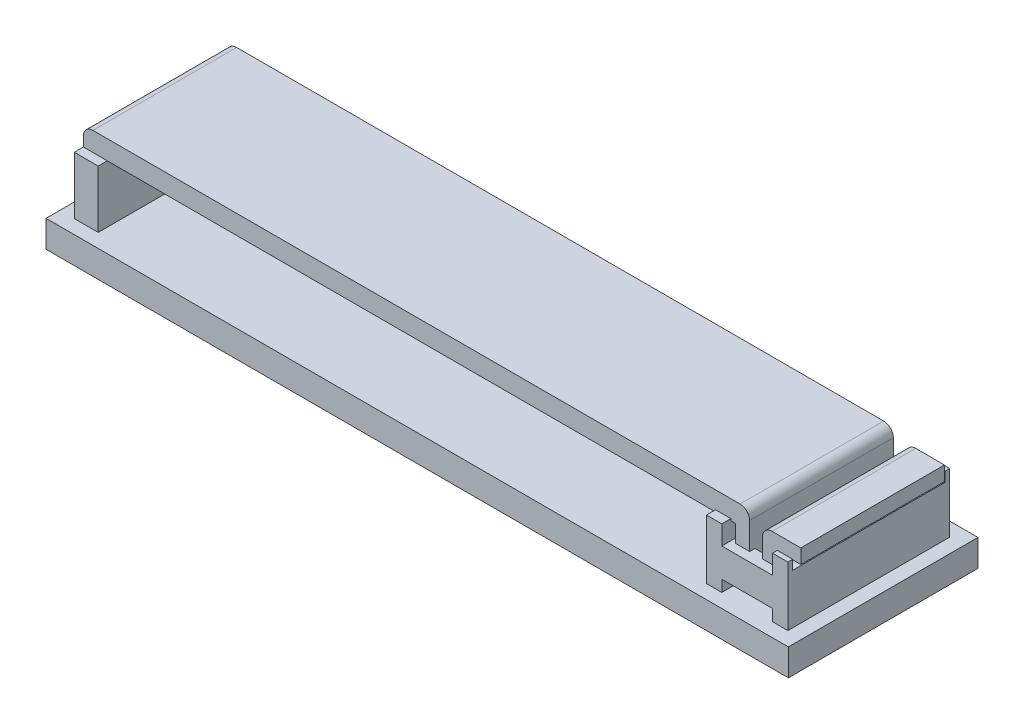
from build123d import *

# Parameters (mm, degrees)
BASE_OUTLINE_W              = 77.5
BASE_OUTLINE_H              = 19.8
CLAMP_BASE_DEPTH            = 2.8
HINGE_AND_LATCH_OUTLINE_W   = 2.5
HINGE_AND_LATCH_OUTLINE_H   = 6
HINGE_AND_LATCH_OUTLINE_W_2 = 8.5
HINGE_AND_LATCH_OUTLINE_H_2 = 6.2
CLIP_HINGE_AND_LATCH_DEPTH  = 8.45
LATCH_SIDES_CUT_REACH       = 45.81
SIDE_CUTS_OUTLINE_W         = 5.3
SIDE_CUTS_OUTLINE_H         = 2
SIDE_CUTS_OUTLINE_H_2       = 1.2
LATCH_THROUGH_CUT_REACH     = 42.603
THROUGH_CUT_OUTLINE_W       = 5.3
THROUGH_CUT_OUTLINE_H       = 13.9
LATCH_FRONT_CUT_REACH       = 79.169
FRONT_CUT_OUTLINE_W         = 15.9
FRONT_CUT_OUTLINE_H         = 1
CLAMP_DEPTH                 = 7.5
CLAMP_FILLETS_R             = 1


with BuildPart() as part:
    # Base Outline → Clamp Base (new body)
    with BuildSketch(Plane(origin=(0, 0, 0), x_dir=(1, 0, 0), z_dir=(0, 1, 0))):
        Rectangle(BASE_OUTLINE_W, BASE_OUTLINE_H)
    extrude(amount=CLAMP_BASE_DEPTH)

    # Hinge and Latch Outline → Clip Hinge and Latch (add, symmetric)
    with BuildSketch(Plane.XY):
        with Locations((-36, 5.8)):
            Rectangle(HINGE_AND_LATCH_OUTLINE_W, HINGE_AND_LATCH_OUTLINE_H)
        with Locations((33, 5.9)):
            Rectangle(HINGE_AND_LATCH_OUTLINE_W_2, HINGE_AND_LATCH_OUTLINE_H_2)
    extrude(amount=CLIP_HINGE_AND_LATCH_DEPTH, both=True)

    # Side Cuts Outline → Latch Sides Cut (cut, up to next)
    with BuildSketch(Plane.XY.offset(8.45), mode=Mode.PRIVATE) as latch_sides_cut_sk1:
        with Locations((33, 8)):
            Rectangle(SIDE_CUTS_OUTLINE_W, SIDE_CUTS_OUTLINE_H)
    latch_sides_cut_tool1 = extrude(latch_sides_cut_sk1.sketch, amount=-LATCH_SIDES_CUT_REACH, mode=Mode.PRIVATE) & part.part
    # Side Cuts Outline → Latch Sides Cut (cut, up to next)
    with BuildSketch(Plane.XY.offset(8.45), mode=Mode.PRIVATE) as latch_sides_cut_sk2:
        with Locations((33, 3.4)):
            Rectangle(SIDE_CUTS_OUTLINE_W, SIDE_CUTS_OUTLINE_H_2)
    latch_sides_cut_tool2 = extrude(latch_sides_cut_sk2.sketch, amount=-LATCH_SIDES_CUT_REACH, mode=Mode.PRIVATE) & part.part
    add(latch_sides_cut_tool1.solids().sort_by_distance((33, 8, 8.45))[0], mode=Mode.SUBTRACT)
    add(latch_sides_cut_tool2.solids().sort_by_distance((33, 3.4, 8.45))[0], mode=Mode.SUBTRACT)

    # Through Cut Outline → Latch Through Cut (cut, up to next)
    with BuildSketch(Plane(origin=(0, 7, 0), x_dir=(1, 0, 0), z_dir=(0, 1, 0)), mode=Mode.PRIVATE) as latch_through_cut_sk1:
        with Locations((33, 0)):
            Rectangle(THROUGH_CUT_OUTLINE_W, THROUGH_CUT_OUTLINE_H)
    latch_through_cut_tool1 = extrude(latch_through_cut_sk1.sketch, amount=-LATCH_THROUGH_CUT_REACH, mode=Mode.PRIVATE) & part.part
    add(latch_through_cut_tool1.solids().sort_by_distance((33, 7, 0))[0], mode=Mode.SUBTRACT)

    # Front Cut Outline → Latch Front Cut (cut, up to next)
    with BuildSketch(Plane(origin=(37.25, 0, 0), x_dir=(0, 0, -1), z_dir=(1, 0, 0)), mode=Mode.PRIVATE) as latch_front_cut_sk1:
        with Locations((0, 8.5)):
            Rectangle(FRONT_CUT_OUTLINE_W, FRONT_CUT_OUTLINE_H)
    latch_front_cut_tool1 = extrude(latch_front_cut_sk1.sketch, amount=-LATCH_FRONT_CUT_REACH, mode=Mode.PRIVATE) & part.part
    add(latch_front_cut_tool1.solids().sort_by_distance((37.25, 8.5, 0))[0], mode=Mode.SUBTRACT)

    # Clamp Outline → Clamp (add, symmetric)
    with BuildSketch(Plane.XY):
        Polygon((-37.25, 8.8), (30.808257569, 8.8), (30.808257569, 3.3), (35.15, 3.3), (35.15, 8.5), (37.65, 8.5), (37.65, 10), (33.65, 10), (33.65, 4.8), (32.308257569, 4.8), (32.308257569, 10.8), (-37.25, 10.8), align=None)
    extrude(amount=CLAMP_DEPTH, both=True)

    # Clamp Fillets
    clamp_fillets_edges = [part.edges().sort_by_distance(p)[0] for p in [
        (35.15, 8.5, 0),
        (33.65, 10, 0),
        (32.308257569, 10.8, 0),
        (-37.25, 10.8, 0),
        (35.15, 3.3, 0),
        (30.808257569, 3.3, 0),
    ]]
    fillet(clamp_fillets_edges, radius=CLAMP_FILLETS_R)


solid = part.part
